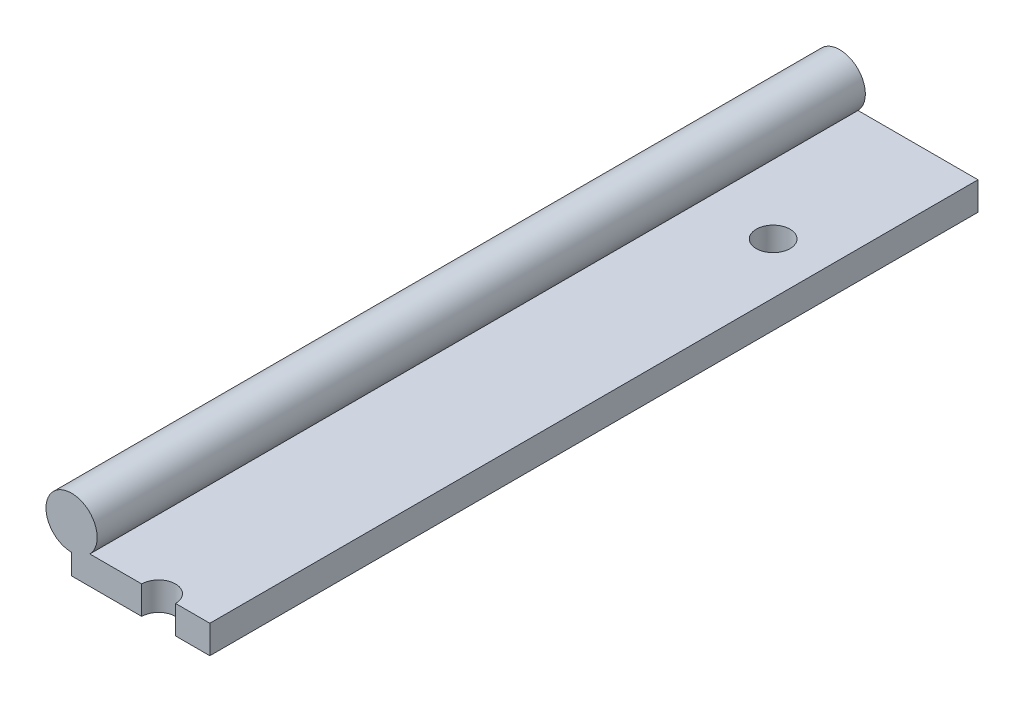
from build123d import *

# Parameters (mm, degrees)
EXTRUIR1_DEPTH                         = 150
TALADRO_DE_DI_METRO_DE_6_6_6_6_1_D     = 6.6
TALADRO_DE_DI_METRO_DE_6_6_6_6_1_DEPTH = 16.5
TALADRO_DE_DI_METRO_DE_6_6_6_6_1_TIP   = 1.982840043


with BuildPart() as part:
    # Croquis1 → Extruir1 (new body)
    with BuildSketch(Plane.XY):
        with BuildLine():
            Line((13.5, 2.75), (-9.929285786, 2.75))
            ThreePointArc((-9.929285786, 2.75), (-15.436491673, 10.859772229), (-13.5, 1.25))
            Line((-13.5, 1.25), (-13.5, -2.75))
            Line((-13.5, -2.75), (13.5, -2.75))
            Line((13.5, -2.75), (13.5, 2.75))
        make_face()
    extrude(amount=EXTRUIR1_DEPTH)

    # Taladro de di_metro de _6.6 _6.6_1
    with Locations(Plane(origin=(3.5, 2.75, 30), x_dir=(1, 0, 0), z_dir=(0, 1, 0))):
        with Locations((0, 0), (0, -120)):
            Hole(TALADRO_DE_DI_METRO_DE_6_6_6_6_1_D / 2, depth=TALADRO_DE_DI_METRO_DE_6_6_6_6_1_DEPTH)
            with Locations((0, 0, -(TALADRO_DE_DI_METRO_DE_6_6_6_6_1_DEPTH + TALADRO_DE_DI_METRO_DE_6_6_6_6_1_TIP / 2))):  # 118° drill point
                Cone(0, TALADRO_DE_DI_METRO_DE_6_6_6_6_1_D / 2, TALADRO_DE_DI_METRO_DE_6_6_6_6_1_TIP, mode=Mode.SUBTRACT)


solid = part.part
